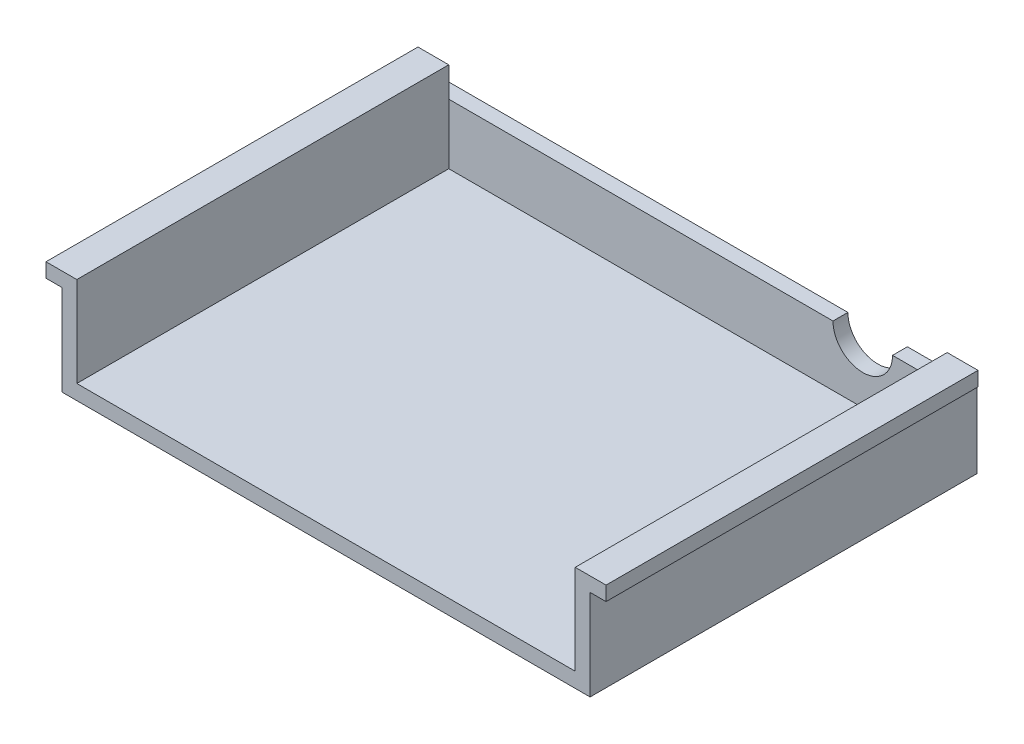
from build123d import *

# Parameters (mm, degrees)
BOSS_EXTRUDE1_DEPTH = 25.4
SKETCH2_W           = 34.036
SKETCH2_H           = 4.1148
BOSS_EXTRUDE2_DEPTH = 1.016
CUT_EXTRUDE1_DEPTH  = 3.048


with BuildPart() as part:
    # Sketch1 → Boss-Extrude1 (new body)
    with BuildSketch(Plane.XY):
        Polygon((-32.110212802, -2.690917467), (1.925787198, -2.690917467), (1.925787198, 3.455882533), (4.029705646, 3.455882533), (4.029705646, 2.478574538), (2.941787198, 2.478574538), (2.941787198, -3.706917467), (-33.126212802, -3.706917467), (-33.126212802, 2.478574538), (-34.21413125, 2.478574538), (-34.21413125, 3.455882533), (-32.110212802, 3.455882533), align=None)
    extrude(amount=BOSS_EXTRUDE1_DEPTH)

    # Sketch2 → Boss-Extrude2 (add)
    with BuildSketch(Plane(origin=(0, 0, 0), x_dir=(-1, 0, 0), z_dir=(0, 0, -1))):
        with Locations((15.092212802, -0.633517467)):
            Rectangle(SKETCH2_W, SKETCH2_H)
        Polygon((-1.925787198, 1.423882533), (-2.941787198, 1.423882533), (-2.941787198, -3.706917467), (33.126212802, -3.706917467), (33.126212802, 1.423882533), (32.110212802, 1.423882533), (32.110212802, -2.690917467), (-1.925787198, -2.690917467), align=None)
    extrude(amount=BOSS_EXTRUDE2_DEPTH)

    # Sketch4 → Cut-Extrude1 (cut)
    with BuildSketch(Plane(origin=(0, 0, -1.016), x_dir=(-1, 0, 0), z_dir=(0, 0, -1))):
        with BuildLine():
            ThreePointArc((5.872012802, 1.423882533), (3.840012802, 3.455882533), (1.808012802, 1.423882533))
            Line((1.808012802, 1.423882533), (3.840012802, 1.423882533))
            Line((3.840012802, 1.423882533), (5.872012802, 1.423882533))
        make_face()
        with BuildLine():
            Line((3.840012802, 1.423882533), (1.808012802, 1.423882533))
            ThreePointArc((1.808012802, 1.423882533), (3.840012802, -0.608117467), (5.872012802, 1.423882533))
            Line((5.872012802, 1.423882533), (3.840012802, 1.423882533))
        make_face()
    extrude(amount=-CUT_EXTRUDE1_DEPTH, mode=Mode.SUBTRACT)


solid = part.part
